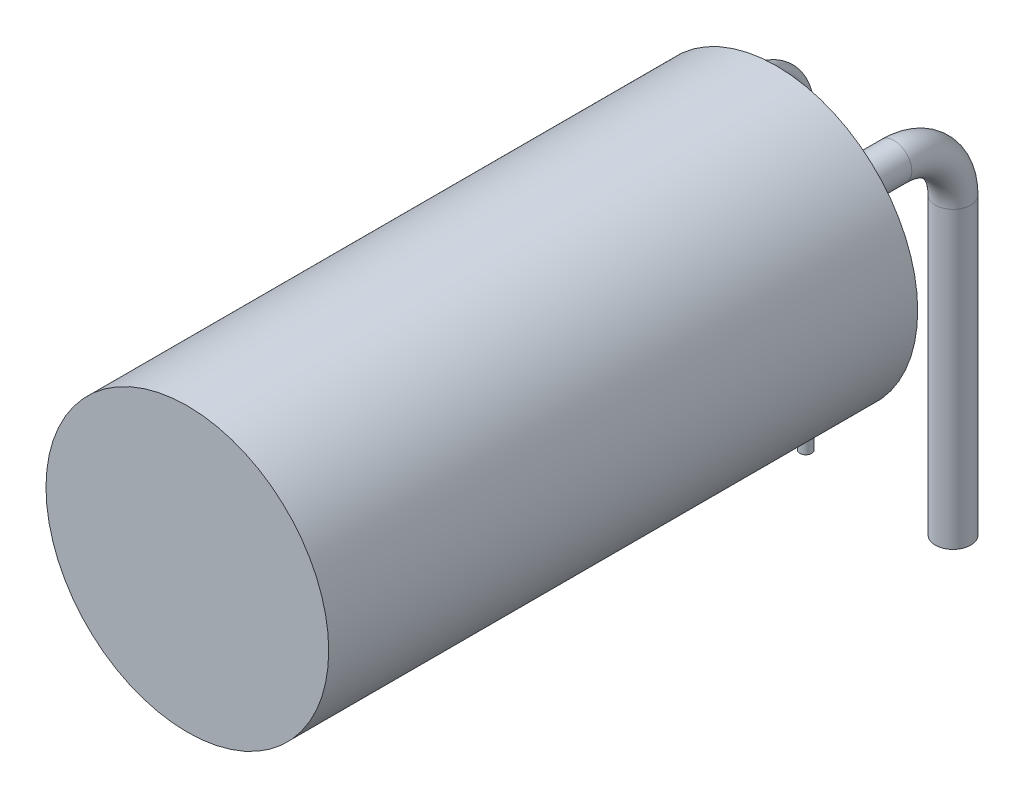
from build123d import *

# Parameters (mm, degrees)
ESQUISSE1_R      = 2.4
EXTRUSION1_DEPTH = 10
ESQUISSE3_R      = 0.3
ESQUISSE5_R      = 0.100951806


with BuildPart() as part:
    # Esquisse1 → Extrusion1 (new body)
    with BuildSketch(Plane.XY):
        Circle(ESQUISSE1_R)
    extrude(amount=EXTRUSION1_DEPTH)

    # Balayage1: sweep along a path in Esquisse2
    with BuildLine(Plane(origin=(0, 0, 0), x_dir=(0, 0, -1), z_dir=(1, 0, 0))) as balayage1_path:
        Line((0, 0), (2, 0))
        ThreePointArc((2, 0), (2.707106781, -0.292893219), (3, -1))
        Line((3, -1), (3, -6))
    # Esquisse3 → Balayage1 (sweep)
    with BuildSketch(Plane(origin=(0, 0, 0), x_dir=(-1, 0, 0), z_dir=(0, 0, -1))):
        Circle(ESQUISSE3_R)
    sweep(path=balayage1_path.line)

    # Balayage2: sweep along a path in Esquisse4
    with BuildLine(Plane(origin=(-2.5, 0, 0), x_dir=(0, 0, -1), z_dir=(1, 0, 0))) as balayage2_path:
        Line((-0.5, 0), (2, 0))
        ThreePointArc((2, 0), (2.707106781, -0.292893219), (3, -1))
        Line((3, -1), (3, -6))
    # Esquisse5 → Balayage2 (sweep)
    with BuildSketch(Plane.XY.offset(0.5)):
        with Locations((-2.5, 0)):
            Circle(ESQUISSE5_R)
    sweep(path=balayage2_path.line)


solid = part.part
